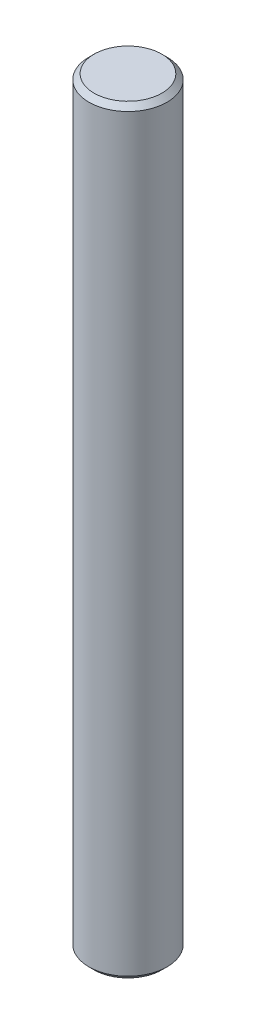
ISO-10303-21;
HEADER;
FILE_DESCRIPTION(('STEP AP214'),'2;1');
FILE_NAME('part.step','',(''),(''),'','','');
FILE_SCHEMA(('AUTOMOTIVE_DESIGN { 1 0 10303 214 1 1 1 1 }'));
ENDSEC;
DATA;
#1=APPLICATION_CONTEXT('core data for automotive mechanical design processes');
#2=APPLICATION_PROTOCOL_DEFINITION('international standard','automotive_design',2000,#1);
#3=PRODUCT_CONTEXT('',#1,'mechanical');
#4=PRODUCT('Part','Part','',(#3));
#5=PRODUCT_RELATED_PRODUCT_CATEGORY('part','',(#4));
#6=PRODUCT_DEFINITION_FORMATION('','',#4);
#7=PRODUCT_DEFINITION_CONTEXT('part definition',#1,'design');
#8=PRODUCT_DEFINITION('design','',#6,#7);
#9=PRODUCT_DEFINITION_SHAPE('','',#8);
#10=(LENGTH_UNIT() NAMED_UNIT(*) SI_UNIT(.MILLI.,.METRE.));
#11=(NAMED_UNIT(*) PLANE_ANGLE_UNIT() SI_UNIT($,.RADIAN.));
#12=(NAMED_UNIT(*) SI_UNIT($,.STERADIAN.) SOLID_ANGLE_UNIT());
#13=UNCERTAINTY_MEASURE_WITH_UNIT(LENGTH_MEASURE(1.E-05),#10,'distance_accuracy_value','');
#14=(GEOMETRIC_REPRESENTATION_CONTEXT(3) GLOBAL_UNCERTAINTY_ASSIGNED_CONTEXT((#13)) GLOBAL_UNIT_ASSIGNED_CONTEXT((#10,
#11,#12)) REPRESENTATION_CONTEXT('',''));
#15=CARTESIAN_POINT('',(0.,0.,0.));
#16=DIRECTION('',(0.,0.,1.));
#17=DIRECTION('',(1.,0.,0.));
#18=AXIS2_PLACEMENT_3D('',#15,#16,#17);
#19=CARTESIAN_POINT('',(0.,7.2875,0.));
#20=DIRECTION('',(0.,-1.,0.));
#21=DIRECTION('',(0.,0.,-1.));
#22=AXIS2_PLACEMENT_3D('',#19,#20,#21);
#23=CYLINDRICAL_SURFACE('',#22,0.75);
#24=CARTESIAN_POINT('',(0.,-7.1875,0.));
#25=DIRECTION('',(0.,1.,0.));
#26=DIRECTION('',(0.,0.,1.));
#27=AXIS2_PLACEMENT_3D('',#24,#25,#26);
#28=CIRCLE('',#27,0.75);
#29=CARTESIAN_POINT('',(0.,-7.1875,0.75));
#30=VERTEX_POINT('',#29);
#31=EDGE_CURVE('E40',#30,#30,#28,.T.);
#32=ORIENTED_EDGE('',*,*,#31,.T.);
#33=EDGE_LOOP('',(#32));
#34=FACE_BOUND('',#33,.T.);
#35=CARTESIAN_POINT('',(0.,7.1875,0.));
#36=DIRECTION('',(0.,1.,0.));
#37=DIRECTION('',(0.,0.,1.));
#38=AXIS2_PLACEMENT_3D('',#35,#36,#37);
#39=CIRCLE('',#38,0.75);
#40=CARTESIAN_POINT('',(0.,7.1875,0.75));
#41=VERTEX_POINT('',#40);
#42=EDGE_CURVE('E44',#41,#41,#39,.F.);
#43=ORIENTED_EDGE('',*,*,#42,.T.);
#44=EDGE_LOOP('',(#43));
#45=FACE_BOUND('',#44,.T.);
#46=ADVANCED_FACE('F29',(#34,#45),#23,.T.);
#47=CARTESIAN_POINT('',(0.,7.2875,0.));
#48=DIRECTION('',(0.,1.,0.));
#49=DIRECTION('',(0.,0.,1.));
#50=AXIS2_PLACEMENT_3D('',#47,#48,#49);
#51=PLANE('',#50);
#52=CARTESIAN_POINT('',(0.,7.2875,0.));
#53=DIRECTION('',(0.,1.,0.));
#54=DIRECTION('',(0.,0.,1.));
#55=AXIS2_PLACEMENT_3D('',#52,#53,#54);
#56=CIRCLE('',#55,0.65);
#57=CARTESIAN_POINT('',(0.,7.2875,0.65));
#58=VERTEX_POINT('',#57);
#59=EDGE_CURVE('E10',#58,#58,#56,.T.);
#60=ORIENTED_EDGE('',*,*,#59,.T.);
#61=EDGE_LOOP('',(#60));
#62=FACE_BOUND('',#61,.T.);
#63=ADVANCED_FACE('F60',(#62),#51,.T.);
#64=CARTESIAN_POINT('',(0.,-7.2875,0.));
#65=DIRECTION('',(0.,1.,0.));
#66=DIRECTION('',(0.,0.,1.));
#67=AXIS2_PLACEMENT_3D('',#64,#65,#66);
#68=PLANE('',#67);
#69=CARTESIAN_POINT('',(0.,-7.2875,0.));
#70=DIRECTION('',(0.,1.,0.));
#71=DIRECTION('',(0.,0.,1.));
#72=AXIS2_PLACEMENT_3D('',#69,#70,#71);
#73=CIRCLE('',#72,0.65);
#74=CARTESIAN_POINT('',(0.,-7.2875,0.65));
#75=VERTEX_POINT('',#74);
#76=EDGE_CURVE('E36',#75,#75,#73,.F.);
#77=ORIENTED_EDGE('',*,*,#76,.T.);
#78=EDGE_LOOP('',(#77));
#79=FACE_BOUND('',#78,.T.);
#80=ADVANCED_FACE('F57',(#79),#68,.F.);
#81=CARTESIAN_POINT('',(0.,-7.1875,0.));
#82=DIRECTION('',(0.,1.,0.));
#83=DIRECTION('',(0.,0.,1.));
#84=AXIS2_PLACEMENT_3D('',#81,#82,#83);
#85=CONICAL_SURFACE('',#84,0.75,0.785398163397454);
#86=ORIENTED_EDGE('',*,*,#76,.F.);
#87=EDGE_LOOP('',(#86));
#88=FACE_BOUND('',#87,.T.);
#89=ORIENTED_EDGE('',*,*,#31,.F.);
#90=EDGE_LOOP('',(#89));
#91=FACE_BOUND('',#90,.T.);
#92=ADVANCED_FACE('F53',(#88,#91),#85,.T.);
#93=CARTESIAN_POINT('',(0.,7.2875,0.));
#94=DIRECTION('',(0.,-1.,0.));
#95=DIRECTION('',(0.,0.,-1.));
#96=AXIS2_PLACEMENT_3D('',#93,#94,#95);
#97=CONICAL_SURFACE('',#96,0.65,0.785398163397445);
#98=ORIENTED_EDGE('',*,*,#42,.F.);
#99=EDGE_LOOP('',(#98));
#100=FACE_BOUND('',#99,.T.);
#101=ORIENTED_EDGE('',*,*,#59,.F.);
#102=EDGE_LOOP('',(#101));
#103=FACE_BOUND('',#102,.T.);
#104=ADVANCED_FACE('F31',(#100,#103),#97,.T.);
#105=CLOSED_SHELL('',(#46,#63,#80,#92,#104));
#106=MANIFOLD_SOLID_BREP('B2',#105);
#107=ADVANCED_BREP_SHAPE_REPRESENTATION('',(#18,#106),#14);
#108=SHAPE_DEFINITION_REPRESENTATION(#9,#107);
ENDSEC;
END-ISO-10303-21;
